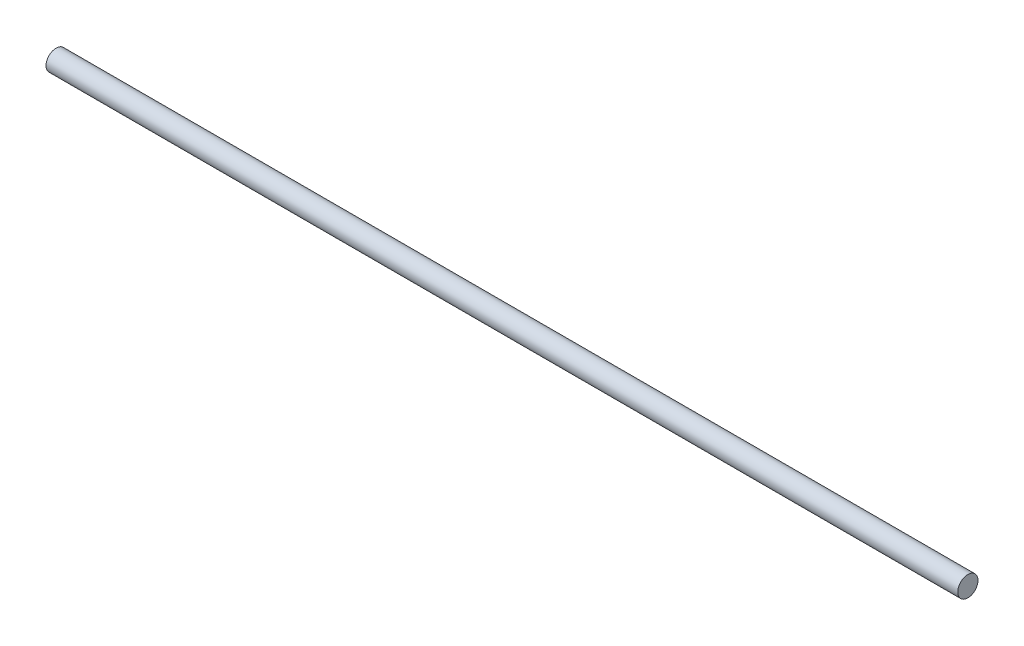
ISO-10303-21;
HEADER;
FILE_DESCRIPTION(('STEP AP214'),'2;1');
FILE_NAME('part.step','',(''),(''),'','','');
FILE_SCHEMA(('AUTOMOTIVE_DESIGN { 1 0 10303 214 1 1 1 1 }'));
ENDSEC;
DATA;
#1=APPLICATION_CONTEXT('core data for automotive mechanical design processes');
#2=APPLICATION_PROTOCOL_DEFINITION('international standard','automotive_design',2000,#1);
#3=PRODUCT_CONTEXT('',#1,'mechanical');
#4=PRODUCT('Part','Part','',(#3));
#5=PRODUCT_RELATED_PRODUCT_CATEGORY('part','',(#4));
#6=PRODUCT_DEFINITION_FORMATION('','',#4);
#7=PRODUCT_DEFINITION_CONTEXT('part definition',#1,'design');
#8=PRODUCT_DEFINITION('design','',#6,#7);
#9=PRODUCT_DEFINITION_SHAPE('','',#8);
#10=(LENGTH_UNIT() NAMED_UNIT(*) SI_UNIT(.MILLI.,.METRE.));
#11=(NAMED_UNIT(*) PLANE_ANGLE_UNIT() SI_UNIT($,.RADIAN.));
#12=(NAMED_UNIT(*) SI_UNIT($,.STERADIAN.) SOLID_ANGLE_UNIT());
#13=UNCERTAINTY_MEASURE_WITH_UNIT(LENGTH_MEASURE(1.E-05),#10,'distance_accuracy_value','');
#14=(GEOMETRIC_REPRESENTATION_CONTEXT(3) GLOBAL_UNCERTAINTY_ASSIGNED_CONTEXT((#13)) GLOBAL_UNIT_ASSIGNED_CONTEXT((#10,
#11,#12)) REPRESENTATION_CONTEXT('',''));
#15=CARTESIAN_POINT('',(0.,0.,0.));
#16=DIRECTION('',(0.,0.,1.));
#17=DIRECTION('',(1.,0.,0.));
#18=AXIS2_PLACEMENT_3D('',#15,#16,#17);
#19=CARTESIAN_POINT('',(90.,0.,0.));
#20=DIRECTION('',(-1.,0.,0.));
#21=DIRECTION('',(0.,0.,1.));
#22=AXIS2_PLACEMENT_3D('',#19,#20,#21);
#23=CYLINDRICAL_SURFACE('',#22,1.);
#24=CARTESIAN_POINT('',(90.,0.,0.));
#25=DIRECTION('',(1.,0.,0.));
#26=DIRECTION('',(0.,0.,-1.));
#27=AXIS2_PLACEMENT_3D('',#24,#25,#26);
#28=CIRCLE('',#27,1.);
#29=CARTESIAN_POINT('',(90.,0.,1.));
#30=VERTEX_POINT('',#29);
#31=EDGE_CURVE('E10',#30,#30,#28,.T.);
#32=CARTESIAN_POINT('',(0.,0.,0.));
#33=DIRECTION('',(1.,0.,0.));
#34=DIRECTION('',(0.,0.,-1.));
#35=AXIS2_PLACEMENT_3D('',#32,#33,#34);
#36=CIRCLE('',#35,1.);
#37=CARTESIAN_POINT('',(0.,0.,1.));
#38=VERTEX_POINT('',#37);
#39=EDGE_CURVE('E32',#38,#38,#36,.T.);
#40=CARTESIAN_POINT('',(90.,0.,1.));
#41=CARTESIAN_POINT('',(89.0625,0.,1.));
#42=CARTESIAN_POINT('',(88.125,0.,1.));
#43=CARTESIAN_POINT('',(86.25,0.,1.));
#44=CARTESIAN_POINT('',(85.3125,0.,1.));
#45=CARTESIAN_POINT('',(83.4375,0.,1.));
#46=CARTESIAN_POINT('',(82.5,0.,1.));
#47=CARTESIAN_POINT('',(80.625,0.,1.));
#48=CARTESIAN_POINT('',(79.6875,0.,1.));
#49=CARTESIAN_POINT('',(77.8125,0.,1.));
#50=CARTESIAN_POINT('',(76.875,0.,1.));
#51=CARTESIAN_POINT('',(75.,0.,1.));
#52=CARTESIAN_POINT('',(74.0625,0.,1.));
#53=CARTESIAN_POINT('',(72.1875,0.,1.));
#54=CARTESIAN_POINT('',(71.25,0.,1.));
#55=CARTESIAN_POINT('',(69.375,0.,1.));
#56=CARTESIAN_POINT('',(68.4375,0.,1.));
#57=CARTESIAN_POINT('',(66.5625,0.,1.));
#58=CARTESIAN_POINT('',(65.625,0.,1.));
#59=CARTESIAN_POINT('',(63.75,0.,1.));
#60=CARTESIAN_POINT('',(62.8125,0.,1.));
#61=CARTESIAN_POINT('',(60.9375,0.,1.));
#62=CARTESIAN_POINT('',(60.,0.,1.));
#63=CARTESIAN_POINT('',(58.125,0.,1.));
#64=CARTESIAN_POINT('',(57.1875,0.,1.));
#65=CARTESIAN_POINT('',(55.3125,0.,1.));
#66=CARTESIAN_POINT('',(54.375,0.,1.));
#67=CARTESIAN_POINT('',(52.5,0.,1.));
#68=CARTESIAN_POINT('',(51.5625,0.,1.));
#69=CARTESIAN_POINT('',(49.6875,0.,1.));
#70=CARTESIAN_POINT('',(48.75,0.,1.));
#71=CARTESIAN_POINT('',(46.875,0.,1.));
#72=CARTESIAN_POINT('',(45.9375,0.,1.));
#73=CARTESIAN_POINT('',(44.0625,0.,1.));
#74=CARTESIAN_POINT('',(43.125,0.,1.));
#75=CARTESIAN_POINT('',(41.25,0.,1.));
#76=CARTESIAN_POINT('',(40.3125,0.,1.));
#77=CARTESIAN_POINT('',(38.4375,0.,1.));
#78=CARTESIAN_POINT('',(37.5,0.,1.));
#79=CARTESIAN_POINT('',(35.625,0.,1.));
#80=CARTESIAN_POINT('',(34.6875,0.,1.));
#81=CARTESIAN_POINT('',(32.8125,0.,1.));
#82=CARTESIAN_POINT('',(31.875,0.,1.));
#83=CARTESIAN_POINT('',(30.,0.,1.));
#84=CARTESIAN_POINT('',(29.0625,0.,1.));
#85=CARTESIAN_POINT('',(27.1875,0.,1.));
#86=CARTESIAN_POINT('',(26.25,0.,1.));
#87=CARTESIAN_POINT('',(24.375,0.,1.));
#88=CARTESIAN_POINT('',(23.4375,0.,1.));
#89=CARTESIAN_POINT('',(21.5625,0.,1.));
#90=CARTESIAN_POINT('',(20.625,0.,1.));
#91=CARTESIAN_POINT('',(18.75,0.,1.));
#92=CARTESIAN_POINT('',(17.8125,0.,1.));
#93=CARTESIAN_POINT('',(15.9375,0.,1.));
#94=CARTESIAN_POINT('',(15.,0.,1.));
#95=CARTESIAN_POINT('',(13.125,0.,1.));
#96=CARTESIAN_POINT('',(12.1875,0.,1.));
#97=CARTESIAN_POINT('',(10.3125,0.,1.));
#98=CARTESIAN_POINT('',(9.37499999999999,0.,1.));
#99=CARTESIAN_POINT('',(7.49999999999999,0.,1.));
#100=CARTESIAN_POINT('',(6.56249999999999,0.,1.));
#101=CARTESIAN_POINT('',(4.68749999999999,0.,1.));
#102=CARTESIAN_POINT('',(3.74999999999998,0.,1.));
#103=CARTESIAN_POINT('',(1.87499999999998,0.,1.));
#104=CARTESIAN_POINT('',(0.937499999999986,0.,1.));
#105=CARTESIAN_POINT('',(0.,0.,1.));
#106=B_SPLINE_CURVE_WITH_KNOTS('',3,(#40,#41,#42,#43,#44,#45,#46,#47,#48,#49,#50,#51,#52,#53,
#54,#55,#56,#57,#58,#59,#60,#61,#62,#63,#64,#65,#66,#67,#68,#69,#70,#71,#72,#73,#74,#75,#76,#77,
#78,#79,#80,#81,#82,#83,#84,#85,#86,#87,#88,#89,#90,#91,#92,#93,#94,#95,#96,#97,#98,#99,#100,
#101,#102,#103,#104,#105),.UNSPECIFIED.,.F.,.F.,(4,2,2,2,2,2,2,2,2,2,2,2,2,2,2,2,2,2,2,2,2,2,2,
2,2,2,2,2,2,2,2,2,4),(0.,2.81250000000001,5.62500000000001,8.43750000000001,11.25,14.0625,
16.875,19.6875,22.5,25.3125,28.125,30.9375,33.75,36.5625,39.375,42.1875,45.,47.8125,50.625,
53.4375,56.25,59.0625,61.875,64.6875,67.5,70.3125,73.125,75.9375,78.75,81.5625,84.375,87.1875,
90.),.UNSPECIFIED.);
#107=EDGE_CURVE('BSEAM29',#30,#38,#106,.T.);
#108=ORIENTED_EDGE('',*,*,#31,.F.);
#109=ORIENTED_EDGE('',*,*,#39,.T.);
#110=ORIENTED_EDGE('',*,*,#107,.T.);
#111=ORIENTED_EDGE('',*,*,#107,.F.);
#112=EDGE_LOOP('',(#108,#110,#109,#111));
#113=FACE_BOUND('',#112,.T.);
#114=ADVANCED_FACE('F29',(#113),#23,.T.);
#115=CARTESIAN_POINT('',(90.,0.,0.));
#116=DIRECTION('',(1.,0.,0.));
#117=DIRECTION('',(0.,0.,-1.));
#118=AXIS2_PLACEMENT_3D('',#115,#116,#117);
#119=PLANE('',#118);
#120=ORIENTED_EDGE('',*,*,#31,.T.);
#121=EDGE_LOOP('',(#120));
#122=FACE_BOUND('',#121,.T.);
#123=ADVANCED_FACE('F44',(#122),#119,.T.);
#124=CARTESIAN_POINT('',(0.,0.,0.));
#125=DIRECTION('',(1.,0.,0.));
#126=DIRECTION('',(0.,0.,-1.));
#127=AXIS2_PLACEMENT_3D('',#124,#125,#126);
#128=PLANE('',#127);
#129=ORIENTED_EDGE('',*,*,#39,.F.);
#130=EDGE_LOOP('',(#129));
#131=FACE_BOUND('',#130,.T.);
#132=ADVANCED_FACE('F42',(#131),#128,.F.);
#133=CLOSED_SHELL('',(#114,#123,#132));
#134=MANIFOLD_SOLID_BREP('B2',#133);
#135=ADVANCED_BREP_SHAPE_REPRESENTATION('',(#18,#134),#14);
#136=SHAPE_DEFINITION_REPRESENTATION(#9,#135);
ENDSEC;
END-ISO-10303-21;
